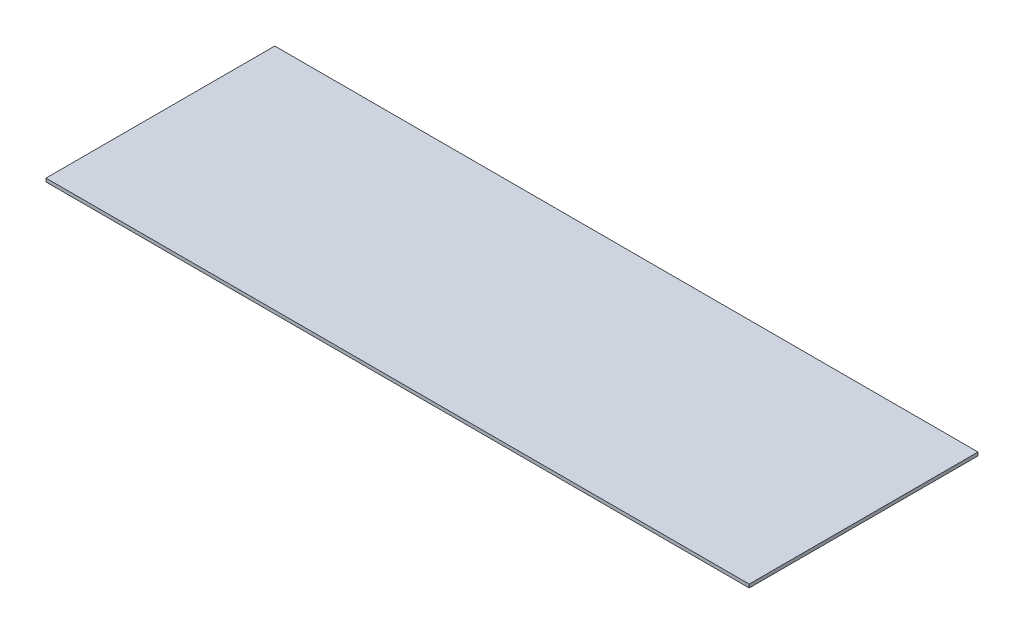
from build123d import *

# Parameters (mm, degrees)
SKETCH1_W      = 1981.2
SKETCH1_H      = 644.525
EXTRUDE1_DEPTH = 9.525


with BuildPart() as part:
    # Sketch1 → Extrude1 (new body)
    with BuildSketch(Plane(origin=(0, 0, 0), x_dir=(1, 0, 0), z_dir=(0, 1, 0))):
        Rectangle(SKETCH1_W, SKETCH1_H)
    extrude(amount=EXTRUDE1_DEPTH)


solid = part.part
